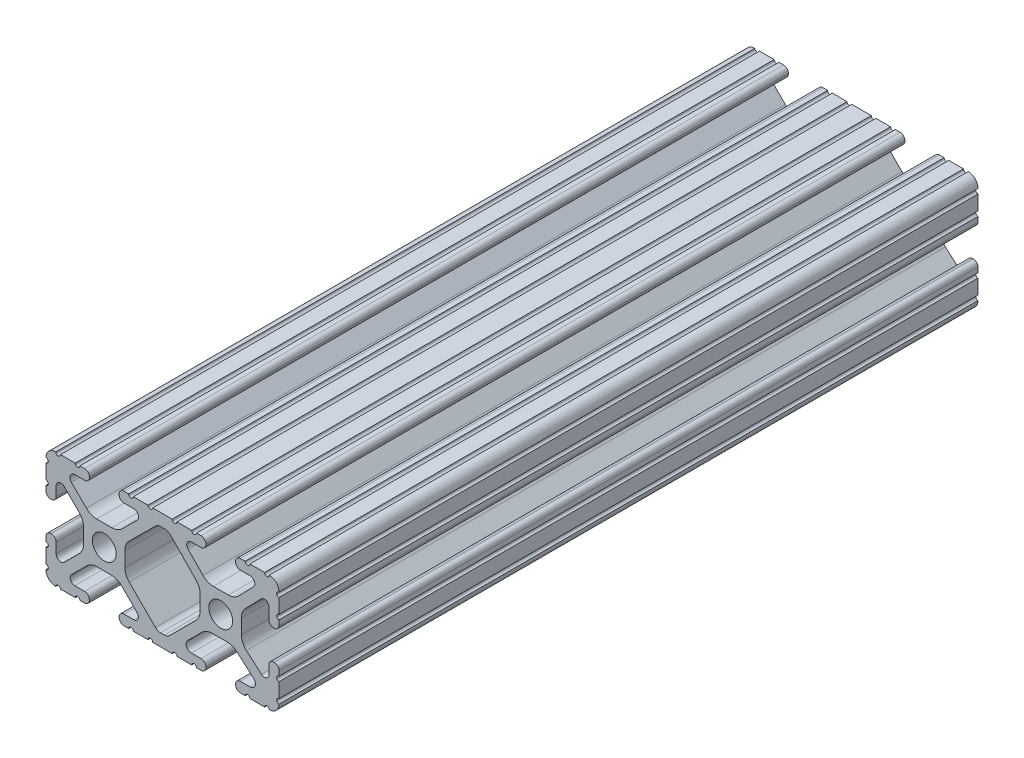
from build123d import *

# Parameters (mm, degrees)
SKETCH1_R           = 2.6035
BOSS_EXTRUDE1_DEPTH = 76.2


with BuildPart() as part:
    # Sketch1 → Boss-Extrude1 (new, symmetric)
    with BuildSketch(Plane.XY):
        with BuildLine():
            Line((18.01710265, 12.7), (16.98745015, 12.7))
            ThreePointArc((16.98745015, 12.7), (16.245730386, 12.392769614), (15.9385, 11.65104985))
            Line((15.9385, 11.65104985), (15.9385, 11.53922))
            ThreePointArc((15.9385, 11.53922), (16.245750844, 10.797450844), (16.98752, 10.4902))
            Line((16.98752, 10.4902), (19.116384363, 10.4902))
            ThreePointArc((19.116384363, 10.4902), (20.052502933, 9.869096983), (19.844087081, 8.765172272))
            Line((19.844087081, 8.765172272), (16.618993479, 5.455112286))
            ThreePointArc((16.618993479, 5.455112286), (15.578994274, 4.745442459), (14.344932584, 4.4958))
            Line((14.344932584, 4.4958), (11.083317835, 4.4958))
            ThreePointArc((11.083317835, 4.4958), (9.854330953, 4.743306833), (8.816955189, 5.447238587))
            Line((8.816955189, 5.447238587), (5.564154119, 8.762652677))
            ThreePointArc((5.564154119, 8.762652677), (5.352591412, 9.867473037), (6.289393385, 10.4902))
            Line((6.289393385, 10.4902), (8.41248, 10.4902))
            ThreePointArc((8.41248, 10.4902), (9.154249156, 10.797450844), (9.4615, 11.53922))
            Line((9.4615, 11.53922), (9.4615, 11.65104985))
            ThreePointArc((9.4615, 11.65104985), (9.154269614, 12.392769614), (8.41254985, 12.7))
            Line((8.41254985, 12.7), (7.38288465, 12.7))
            ThreePointArc((7.38288465, 12.7), (6.87488465, 12.192), (6.36688465, 12.7))
            Line((6.36688465, 12.7), (3.14958095, 12.7))
            ThreePointArc((3.14958095, 12.7), (2.64158095, 12.192), (2.13358095, 12.7))
            Line((2.13358095, 12.7), (-2.13358095, 12.7))
            ThreePointArc((-2.13358095, 12.7), (-2.64158095, 12.192), (-3.14958095, 12.7))
            Line((-3.14958095, 12.7), (-6.36689735, 12.7))
            ThreePointArc((-6.36689735, 12.7), (-6.87489735, 12.192), (-7.38289735, 12.7))
            Line((-7.38289735, 12.7), (-8.41254985, 12.7))
            ThreePointArc((-8.41254985, 12.7), (-9.154269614, 12.392769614), (-9.4615, 11.65104985))
            Line((-9.4615, 11.65104985), (-9.4615, 11.53922))
            ThreePointArc((-9.4615, 11.53922), (-9.154249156, 10.797450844), (-8.41248, 10.4902))
            Line((-8.41248, 10.4902), (-6.283641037, 10.4902))
            ThreePointArc((-6.283641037, 10.4902), (-5.297291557, 9.829633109), (-5.532576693, 8.666071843))
            Line((-5.532576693, 8.666071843), (-8.809985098, 5.416263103))
            ThreePointArc((-8.809985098, 5.416263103), (-9.836720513, 4.734920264), (-11.045536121, 4.4958))
            Line((-11.045536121, 4.4958), (-14.354463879, 4.4958))
            ThreePointArc((-14.354463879, 4.4958), (-15.563279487, 4.734920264), (-16.590014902, 5.416263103))
            Line((-16.590014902, 5.416263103), (-19.867423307, 8.666071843))
            ThreePointArc((-19.867423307, 8.666071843), (-20.102708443, 9.829633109), (-19.116358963, 10.4902))
            Line((-19.116358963, 10.4902), (-16.98752, 10.4902))
            ThreePointArc((-16.98752, 10.4902), (-16.245750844, 10.797450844), (-15.9385, 11.53922))
            Line((-15.9385, 11.53922), (-15.9385, 11.65104985))
            ThreePointArc((-15.9385, 11.65104985), (-16.245730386, 12.392769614), (-16.98745015, 12.7))
            Line((-16.98745015, 12.7), (-18.01711535, 12.7))
            ThreePointArc((-18.01711535, 12.7), (-18.52511535, 12.192), (-19.03311535, 12.7))
            Line((-19.03311535, 12.7), (-22.2504, 12.7))
            ThreePointArc((-22.2504, 12.7), (-22.758323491, 12.192000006), (-23.266399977, 12.699846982))
            ThreePointArc((-23.266399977, 12.699846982), (-24.782522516, 12.082522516), (-25.399846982, 10.566399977))
            ThreePointArc((-25.399846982, 10.566399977), (-24.892000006, 10.058323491), (-25.4, 9.5504))
            Line((-25.4, 9.5504), (-25.4, 6.3330836))
            ThreePointArc((-25.4, 6.3330836), (-24.892, 5.8250836), (-25.4, 5.3170836))
            Line((-25.4, 5.3170836), (-25.4, 4.237520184))
            ThreePointArc((-25.4, 4.237520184), (-25.107393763, 3.531106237), (-24.400979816, 3.2385))
            Line((-24.400979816, 3.2385), (-24.23922, 3.2385))
            ThreePointArc((-24.23922, 3.2385), (-23.497450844, 3.545750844), (-23.1902, 4.28752))
            Line((-23.1902, 4.28752), (-23.1902, 6.334741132))
            ThreePointArc((-23.1902, 6.334741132), (-22.556026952, 7.286023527), (-21.434002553, 7.066535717))
            Line((-21.434002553, 7.066535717), (-18.147950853, 3.808156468))
            ThreePointArc((-18.147950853, 3.808156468), (-17.452759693, 2.774838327), (-17.208501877, 1.553619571))
            Line((-17.208501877, 1.553619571), (-17.208501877, -1.695179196))
            ThreePointArc((-17.208501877, -1.695179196), (-17.450738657, -2.911536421), (-18.140486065, -3.942289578))
            Line((-18.140486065, -3.942289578), (-21.431579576, -7.227386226))
            ThreePointArc((-21.431579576, -7.227386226), (-22.55444896, -7.449940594), (-23.1902, -6.498002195))
            Line((-23.1902, -6.498002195), (-23.1902, -4.28752))
            ThreePointArc((-23.1902, -4.28752), (-23.497450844, -3.545750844), (-24.23922, -3.2385))
            Line((-24.23922, -3.2385), (-24.35098, -3.2385))
            ThreePointArc((-24.35098, -3.2385), (-25.092749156, -3.545750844), (-25.4, -4.28752))
            Line((-25.4, -4.28752), (-25.4, -5.3171344))
            ThreePointArc((-25.4, -5.3171344), (-24.892, -5.8251344), (-25.4, -6.3331344))
            Line((-25.4, -6.3331344), (-25.4, -9.5504))
            ThreePointArc((-25.4, -9.5504), (-24.892000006, -10.058323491), (-25.399846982, -10.566399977))
            ThreePointArc((-25.399846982, -10.566399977), (-24.782522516, -12.082522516), (-23.266399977, -12.699846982))
            ThreePointArc((-23.266399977, -12.699846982), (-22.758323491, -12.192000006), (-22.2504, -12.7))
            Line((-22.2504, -12.7), (-19.03308995, -12.7))
            ThreePointArc((-19.03308995, -12.7), (-18.52508995, -12.192), (-18.01708995, -12.7))
            Line((-18.01708995, -12.7), (-16.9874692, -12.7))
            ThreePointArc((-16.9874692, -12.7), (-16.245700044, -12.392749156), (-15.9384492, -11.65098))
            Line((-15.9384492, -11.65098), (-15.9384492, -11.53922))
            ThreePointArc((-15.9384492, -11.53922), (-16.245700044, -10.797450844), (-16.9874692, -10.4902))
            Line((-16.9874692, -10.4902), (-19.116358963, -10.4902))
            ThreePointArc((-19.116358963, -10.4902), (-20.055197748, -9.862578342), (-19.834124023, -8.755124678))
            Line((-19.834124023, -8.755124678), (-16.49660751, -5.423689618))
            ThreePointArc((-16.49660751, -5.423689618), (-15.467274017, -4.736928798), (-14.253591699, -4.4958))
            Line((-14.253591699, -4.4958), (-11.146408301, -4.4958))
            ThreePointArc((-11.146408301, -4.4958), (-9.932725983, -4.736928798), (-8.90339249, -5.423689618))
            Line((-8.90339249, -5.423689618), (-5.565875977, -8.755124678))
            ThreePointArc((-5.565875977, -8.755124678), (-5.344802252, -9.862578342), (-6.283641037, -10.4902))
            Line((-6.283641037, -10.4902), (-8.4125308, -10.4902))
            ThreePointArc((-8.4125308, -10.4902), (-9.154299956, -10.797450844), (-9.4615508, -11.53922))
            Line((-9.4615508, -11.53922), (-9.4615508, -11.65098))
            ThreePointArc((-9.4615508, -11.65098), (-9.154299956, -12.392749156), (-8.4125308, -12.7))
            Line((-8.4125308, -12.7), (-7.38287195, -12.7))
            ThreePointArc((-7.38287195, -12.7), (-6.87487195, -12.192), (-6.36687195, -12.7))
            Line((-6.36687195, -12.7), (-3.14960635, -12.7))
            ThreePointArc((-3.14960635, -12.7), (-2.64160635, -12.192), (-2.13360635, -12.7))
            Line((-2.13360635, -12.7), (2.13360635, -12.7))
            ThreePointArc((2.13360635, -12.7), (2.64159365, -12.1920127), (3.14958095, -12.7))
            Line((3.14958095, -12.7), (6.36691005, -12.7))
            ThreePointArc((6.36691005, -12.7), (6.87491005, -12.192), (7.38291005, -12.7))
            Line((7.38291005, -12.7), (8.4125308, -12.7))
            ThreePointArc((8.4125308, -12.7), (9.154299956, -12.392749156), (9.4615508, -11.65098))
            Line((9.4615508, -11.65098), (9.4615508, -11.53922))
            ThreePointArc((9.4615508, -11.53922), (9.154299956, -10.797450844), (8.4125308, -10.4902))
            Line((8.4125308, -10.4902), (6.289393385, -10.4902))
            ThreePointArc((6.289393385, -10.4902), (5.231590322, -9.783049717), (5.480677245, -8.535265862))
            Line((5.480677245, -8.535265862), (8.597933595, -5.423689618))
            ThreePointArc((8.597933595, -5.423689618), (9.627267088, -4.736928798), (10.840949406, -4.4958))
            Line((10.840949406, -4.4958), (14.102564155, -4.4958))
            ThreePointArc((14.102564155, -4.4958), (15.215927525, -4.697410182), (16.187895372, -5.276636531))
            Line((16.187895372, -5.276636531), (19.868247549, -8.482246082))
            ThreePointArc((19.868247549, -8.482246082), (20.188435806, -9.746879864), (19.116384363, -10.4902))
            Line((19.116384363, -10.4902), (16.9874692, -10.4902))
            ThreePointArc((16.9874692, -10.4902), (16.245700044, -10.797450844), (15.9384492, -11.53922))
            Line((15.9384492, -11.53922), (15.9384492, -11.65098))
            ThreePointArc((15.9384492, -11.65098), (16.245700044, -12.392749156), (16.9874692, -12.7))
            Line((16.9874692, -12.7), (18.01710265, -12.7))
            ThreePointArc((18.01710265, -12.7), (18.52510265, -12.192), (19.03310265, -12.7))
            Line((19.03310265, -12.7), (22.2504, -12.7))
            ThreePointArc((22.2504, -12.7), (22.758323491, -12.192000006), (23.266399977, -12.699846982))
            ThreePointArc((23.266399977, -12.699846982), (24.782522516, -12.082522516), (25.399846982, -10.566399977))
            ThreePointArc((25.399846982, -10.566399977), (24.892000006, -10.058323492), (25.4, -9.550400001))
            Line((25.4, -9.550400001), (25.4, -6.333083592))
            ThreePointArc((25.4, -6.333083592), (24.892000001, -5.825083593), (25.4, -5.317083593))
            Line((25.4, -5.317083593), (25.4, -4.237520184))
            ThreePointArc((25.4, -4.237520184), (25.107393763, -3.531106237), (24.400979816, -3.2385))
            Line((24.400979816, -3.2385), (24.189220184, -3.2385))
            ThreePointArc((24.189220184, -3.2385), (23.482806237, -3.531106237), (23.1902, -4.237520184))
            Line((23.1902, -4.237520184), (23.1902, -6.155876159))
            ThreePointArc((23.1902, -6.155876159), (22.62232736, -7.038258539), (21.583974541, -6.886926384))
            Line((21.583974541, -6.886926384), (18.29817066, -4.024970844))
            ThreePointArc((18.29817066, -4.024970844), (17.493730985, -2.946044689), (17.208501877, -1.630807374))
            Line((17.208501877, -1.630807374), (17.208501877, 1.630807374))
            ThreePointArc((17.208501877, 1.630807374), (17.442348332, 2.82673414), (18.109440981, 3.846495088))
            Line((18.109440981, 3.846495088), (21.526346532, 7.353420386))
            ThreePointArc((21.526346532, 7.353420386), (22.585896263, 7.574939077), (23.1902, 6.676867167))
            Line((23.1902, 6.676867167), (23.1902, 4.237520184))
            ThreePointArc((23.1902, 4.237520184), (23.482806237, 3.531106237), (24.189220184, 3.2385))
            Line((24.189220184, 3.2385), (24.400979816, 3.2385))
            ThreePointArc((24.400979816, 3.2385), (25.107393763, 3.531106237), (25.4, 4.237520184))
            Line((25.4, 4.237520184), (25.4, 5.3170836))
            ThreePointArc((25.4, 5.3170836), (24.891949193, 5.825134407), (25.4, 6.333185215))
            Line((25.4, 6.333185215), (25.4, 9.550400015))
            ThreePointArc((25.4, 9.550400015), (24.892000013, 10.058323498), (25.399846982, 10.566399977))
            ThreePointArc((25.399846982, 10.566399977), (24.782522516, 12.082522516), (23.266399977, 12.699846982))
            ThreePointArc((23.266399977, 12.699846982), (22.758323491, 12.192000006), (22.2504, 12.7))
            Line((22.2504, 12.7), (19.03310265, 12.7))
            ThreePointArc((19.03310265, 12.7), (18.52510265, 12.192), (18.01710265, 12.7))
        make_face()
        with Locations(Location((-12.7, 0, 0), (0, 0, 180))):
            Circle(SKETCH1_R, mode=Mode.SUBTRACT)
        with Locations(Location((12.7, 0, 0), (0, 0, 180))):
            Circle(SKETCH1_R, mode=Mode.SUBTRACT)
        with BuildLine():
            Line((-7.259513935, -3.869413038), (-1.545748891, -9.572766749))
            ThreePointArc((-1.545748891, -9.572766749), (-1.035199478, -9.913400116), (-0.433213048, -10.033))
            Line((-0.433213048, -10.033), (0.433213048, -10.033))
            ThreePointArc((0.433213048, -10.033), (1.035199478, -9.913400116), (1.545748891, -9.572766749))
            Line((1.545748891, -9.572766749), (7.259513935, -3.869413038))
            ThreePointArc((7.259513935, -3.869413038), (7.949261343, -2.838659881), (8.191498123, -1.622302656))
            Line((8.191498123, -1.622302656), (8.191498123, 1.622302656))
            ThreePointArc((8.191498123, 1.622302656), (7.955573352, 2.823327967), (7.282860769, 3.845864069))
            Line((7.282860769, 3.845864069), (1.675572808, 9.561086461))
            ThreePointArc((1.675572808, 9.561086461), (1.161034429, 9.910236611), (0.551456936, 10.033))
            Line((0.551456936, 10.033), (-0.395199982, 10.033))
            ThreePointArc((-0.395199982, 10.033), (-0.994772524, 9.914396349), (-1.50403329, 9.576450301))
            Line((-1.50403329, 9.576450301), (-7.252049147, 3.876839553))
            ThreePointArc((-7.252049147, 3.876839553), (-7.947240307, 2.843521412), (-8.191498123, 1.622302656))
            Line((-8.191498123, 1.622302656), (-8.191498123, -1.622302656))
            ThreePointArc((-8.191498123, -1.622302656), (-7.949261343, -2.838659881), (-7.259513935, -3.869413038))
        make_face(mode=Mode.SUBTRACT)
    extrude(amount=BOSS_EXTRUDE1_DEPTH, both=True)


solid = part.part
